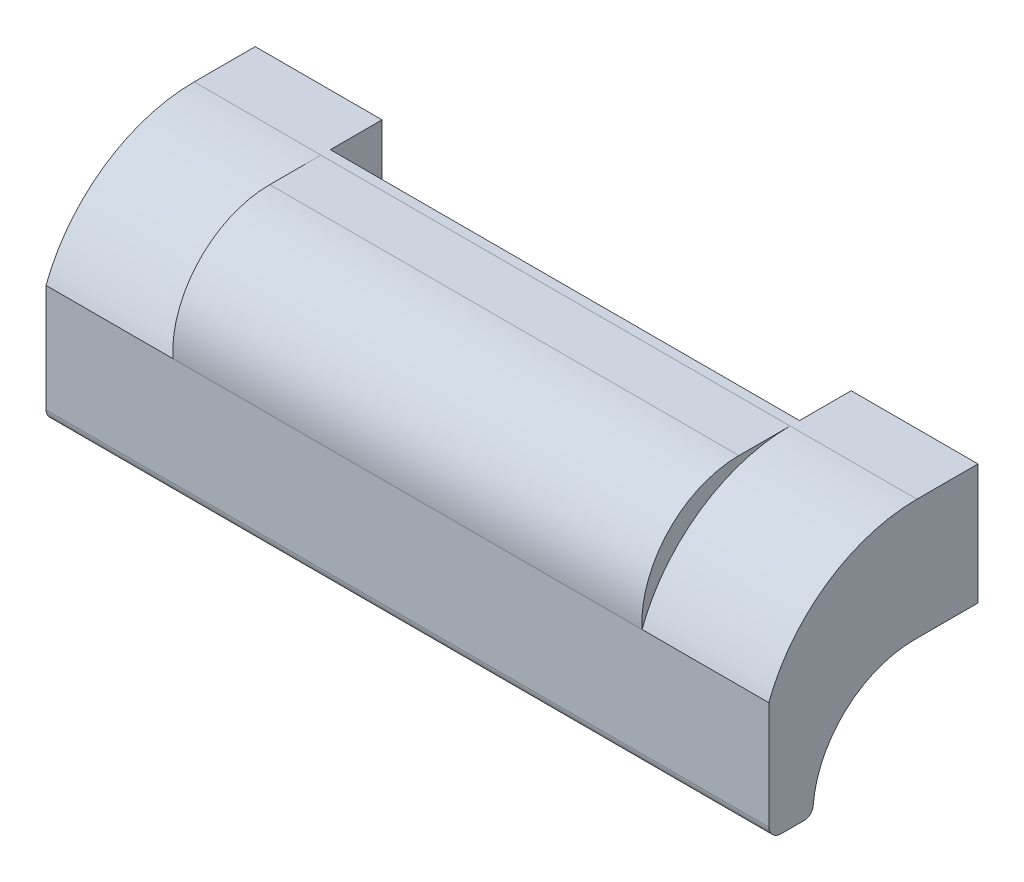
ISO-10303-21;
HEADER;
FILE_DESCRIPTION(('STEP AP214'),'2;1');
FILE_NAME('part.step','',(''),(''),'','','');
FILE_SCHEMA(('AUTOMOTIVE_DESIGN { 1 0 10303 214 1 1 1 1 }'));
ENDSEC;
DATA;
#1=APPLICATION_CONTEXT('core data for automotive mechanical design processes');
#2=APPLICATION_PROTOCOL_DEFINITION('international standard','automotive_design',2000,#1);
#3=PRODUCT_CONTEXT('',#1,'mechanical');
#4=PRODUCT('Part','Part','',(#3));
#5=PRODUCT_RELATED_PRODUCT_CATEGORY('part','',(#4));
#6=PRODUCT_DEFINITION_FORMATION('','',#4);
#7=PRODUCT_DEFINITION_CONTEXT('part definition',#1,'design');
#8=PRODUCT_DEFINITION('design','',#6,#7);
#9=PRODUCT_DEFINITION_SHAPE('','',#8);
#10=(LENGTH_UNIT() NAMED_UNIT(*) SI_UNIT(.MILLI.,.METRE.));
#11=(NAMED_UNIT(*) PLANE_ANGLE_UNIT() SI_UNIT($,.RADIAN.));
#12=(NAMED_UNIT(*) SI_UNIT($,.STERADIAN.) SOLID_ANGLE_UNIT());
#13=UNCERTAINTY_MEASURE_WITH_UNIT(LENGTH_MEASURE(1.E-05),#10,'distance_accuracy_value','');
#14=(GEOMETRIC_REPRESENTATION_CONTEXT(3) GLOBAL_UNCERTAINTY_ASSIGNED_CONTEXT((#13)) GLOBAL_UNIT_ASSIGNED_CONTEXT((#10,
#11,#12)) REPRESENTATION_CONTEXT('',''));
#15=CARTESIAN_POINT('',(0.,0.,0.));
#16=DIRECTION('',(0.,0.,1.));
#17=DIRECTION('',(1.,0.,0.));
#18=AXIS2_PLACEMENT_3D('',#15,#16,#17);
#19=CARTESIAN_POINT('',(0.,0.,11.01));
#20=DIRECTION('',(0.,0.,-1.));
#21=DIRECTION('',(-1.,0.,0.));
#22=AXIS2_PLACEMENT_3D('',#19,#20,#21);
#23=PLANE('',#22);
#24=DIRECTION('',(0.5,0.866025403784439,0.));
#25=VECTOR('',#24,1.);
#26=CARTESIAN_POINT('',(99.2735026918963,0.,11.01));
#27=LINE('',#26,#25);
#28=CARTESIAN_POINT('',(99.2735026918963,0.,11.01));
#29=VERTEX_POINT('',#28);
#30=CARTESIAN_POINT('',(96.3867513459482,-5.00000000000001,11.01));
#31=VERTEX_POINT('',#30);
#32=EDGE_CURVE('E286',#29,#31,#27,.F.);
#33=ORIENTED_EDGE('',*,*,#32,.T.);
#34=DIRECTION('',(1.,0.,0.));
#35=VECTOR('',#34,1.);
#36=CARTESIAN_POINT('',(96.3867513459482,-5.,11.01));
#37=LINE('',#36,#35);
#38=CARTESIAN_POINT('',(90.6132486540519,-4.99999999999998,11.01));
#39=VERTEX_POINT('',#38);
#40=EDGE_CURVE('E280',#31,#39,#37,.F.);
#41=ORIENTED_EDGE('',*,*,#40,.T.);
#42=DIRECTION('',(0.499999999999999,-0.86602540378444,0.));
#43=VECTOR('',#42,1.);
#44=CARTESIAN_POINT('',(90.6132486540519,-4.99999999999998,11.01));
#45=LINE('',#44,#43);
#46=CARTESIAN_POINT('',(87.7264973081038,0.,11.01));
#47=VERTEX_POINT('',#46);
#48=EDGE_CURVE('E274',#39,#47,#45,.F.);
#49=ORIENTED_EDGE('',*,*,#48,.T.);
#50=DIRECTION('',(-0.499999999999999,-0.866025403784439,0.));
#51=VECTOR('',#50,1.);
#52=CARTESIAN_POINT('',(87.7264973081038,0.,11.01));
#53=LINE('',#52,#51);
#54=CARTESIAN_POINT('',(90.6132486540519,5.,11.01));
#55=VERTEX_POINT('',#54);
#56=EDGE_CURVE('E303',#47,#55,#53,.F.);
#57=ORIENTED_EDGE('',*,*,#56,.T.);
#58=DIRECTION('',(-1.,0.,0.));
#59=VECTOR('',#58,1.);
#60=CARTESIAN_POINT('',(90.6132486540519,5.,11.01));
#61=LINE('',#60,#59);
#62=CARTESIAN_POINT('',(96.3867513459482,5.,11.01));
#63=VERTEX_POINT('',#62);
#64=EDGE_CURVE('E298',#55,#63,#61,.F.);
#65=ORIENTED_EDGE('',*,*,#64,.T.);
#66=DIRECTION('',(-0.5,0.866025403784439,0.));
#67=VECTOR('',#66,1.);
#68=CARTESIAN_POINT('',(96.3867513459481,5.,11.01));
#69=LINE('',#68,#67);
#70=EDGE_CURVE('E292',#63,#29,#69,.F.);
#71=ORIENTED_EDGE('',*,*,#70,.T.);
#72=EDGE_LOOP('',(#33,#41,#49,#57,#65,#71));
#73=FACE_BOUND('',#72,.T.);
#74=ADVANCED_FACE('F14',(#73),#23,.T.);
#75=CARTESIAN_POINT('',(0.,0.,11.01));
#76=DIRECTION('',(0.,0.,-1.));
#77=DIRECTION('',(-1.,0.,0.));
#78=AXIS2_PLACEMENT_3D('',#75,#76,#77);
#79=PLANE('',#78);
#80=DIRECTION('',(0.5,0.866025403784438,0.));
#81=VECTOR('',#80,1.);
#82=CARTESIAN_POINT('',(5.77350269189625,0.,11.01));
#83=LINE('',#82,#81);
#84=CARTESIAN_POINT('',(5.77350269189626,0.,11.01));
#85=VERTEX_POINT('',#84);
#86=CARTESIAN_POINT('',(2.88675134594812,-5.,11.01));
#87=VERTEX_POINT('',#86);
#88=EDGE_CURVE('E251',#85,#87,#83,.F.);
#89=ORIENTED_EDGE('',*,*,#88,.T.);
#90=DIRECTION('',(1.,0.,0.));
#91=VECTOR('',#90,1.);
#92=CARTESIAN_POINT('',(2.88675134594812,-5.,11.01));
#93=LINE('',#92,#91);
#94=CARTESIAN_POINT('',(-2.88675134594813,-5.,11.01));
#95=VERTEX_POINT('',#94);
#96=EDGE_CURVE('E245',#87,#95,#93,.F.);
#97=ORIENTED_EDGE('',*,*,#96,.T.);
#98=DIRECTION('',(0.499999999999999,-0.866025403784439,0.));
#99=VECTOR('',#98,1.);
#100=CARTESIAN_POINT('',(-2.88675134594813,-5.,11.01));
#101=LINE('',#100,#99);
#102=CARTESIAN_POINT('',(-5.77350269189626,0.,11.01));
#103=VERTEX_POINT('',#102);
#104=EDGE_CURVE('E239',#95,#103,#101,.F.);
#105=ORIENTED_EDGE('',*,*,#104,.T.);
#106=DIRECTION('',(-0.5,-0.866025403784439,0.));
#107=VECTOR('',#106,1.);
#108=CARTESIAN_POINT('',(-5.77350269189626,0.,11.01));
#109=LINE('',#108,#107);
#110=CARTESIAN_POINT('',(-2.88675134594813,5.,11.01));
#111=VERTEX_POINT('',#110);
#112=EDGE_CURVE('E269',#103,#111,#109,.F.);
#113=ORIENTED_EDGE('',*,*,#112,.T.);
#114=DIRECTION('',(-1.,0.,0.));
#115=VECTOR('',#114,1.);
#116=CARTESIAN_POINT('',(-2.88675134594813,5.,11.01));
#117=LINE('',#116,#115);
#118=CARTESIAN_POINT('',(2.88675134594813,5.,11.01));
#119=VERTEX_POINT('',#118);
#120=EDGE_CURVE('E263',#111,#119,#117,.F.);
#121=ORIENTED_EDGE('',*,*,#120,.T.);
#122=DIRECTION('',(-0.5,0.866025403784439,0.));
#123=VECTOR('',#122,1.);
#124=CARTESIAN_POINT('',(2.88675134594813,5.,11.01));
#125=LINE('',#124,#123);
#126=EDGE_CURVE('E257',#119,#85,#125,.F.);
#127=ORIENTED_EDGE('',*,*,#126,.T.);
#128=EDGE_LOOP('',(#89,#97,#105,#113,#121,#127));
#129=FACE_BOUND('',#128,.T.);
#130=ADVANCED_FACE('F857',(#129),#79,.T.);
#131=CARTESIAN_POINT('',(87.7264973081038,0.,11.01));
#132=DIRECTION('',(-0.866025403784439,0.499999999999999,0.));
#133=DIRECTION('',(-0.499999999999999,-0.866025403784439,0.));
#134=AXIS2_PLACEMENT_3D('',#131,#132,#133);
#135=PLANE('',#134);
#136=DIRECTION('',(0.,0.,1.));
#137=VECTOR('',#136,1.);
#138=CARTESIAN_POINT('',(90.6132486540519,5.,11.01));
#139=LINE('',#138,#137);
#140=CARTESIAN_POINT('',(90.6132486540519,5.,6.00000000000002));
#141=VERTEX_POINT('',#140);
#142=EDGE_CURVE('E301',#141,#55,#139,.T.);
#143=ORIENTED_EDGE('',*,*,#142,.T.);
#144=ORIENTED_EDGE('',*,*,#56,.F.);
#145=DIRECTION('',(0.,0.,1.));
#146=VECTOR('',#145,1.);
#147=CARTESIAN_POINT('',(87.7264973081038,0.,11.01));
#148=LINE('',#147,#146);
#149=CARTESIAN_POINT('',(87.7264973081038,0.,6.00000000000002));
#150=VERTEX_POINT('',#149);
#151=EDGE_CURVE('E272',#47,#150,#148,.F.);
#152=ORIENTED_EDGE('',*,*,#151,.T.);
#153=DIRECTION('',(0.499999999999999,0.866025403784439,0.));
#154=VECTOR('',#153,1.);
#155=CARTESIAN_POINT('',(87.7264973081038,0.,6.0000000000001));
#156=LINE('',#155,#154);
#157=EDGE_CURVE('E220',#150,#141,#156,.T.);
#158=ORIENTED_EDGE('',*,*,#157,.T.);
#159=EDGE_LOOP('',(#143,#144,#152,#158));
#160=FACE_BOUND('',#159,.T.);
#161=ADVANCED_FACE('F510',(#160),#135,.F.);
#162=CARTESIAN_POINT('',(90.6132486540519,5.,11.01));
#163=DIRECTION('',(0.,1.,0.));
#164=DIRECTION('',(-1.,0.,0.));
#165=AXIS2_PLACEMENT_3D('',#162,#163,#164);
#166=PLANE('',#165);
#167=DIRECTION('',(0.,0.,1.));
#168=VECTOR('',#167,1.);
#169=CARTESIAN_POINT('',(96.3867513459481,5.,11.01));
#170=LINE('',#169,#168);
#171=CARTESIAN_POINT('',(96.3867513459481,5.,6.00000000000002));
#172=VERTEX_POINT('',#171);
#173=EDGE_CURVE('E295',#172,#63,#170,.T.);
#174=ORIENTED_EDGE('',*,*,#173,.T.);
#175=ORIENTED_EDGE('',*,*,#64,.F.);
#176=ORIENTED_EDGE('',*,*,#142,.F.);
#177=DIRECTION('',(-1.,0.,0.));
#178=VECTOR('',#177,1.);
#179=CARTESIAN_POINT('',(93.5,5.,6.0000000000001));
#180=LINE('',#179,#178);
#181=EDGE_CURVE('E222',#141,#172,#180,.F.);
#182=ORIENTED_EDGE('',*,*,#181,.T.);
#183=EDGE_LOOP('',(#174,#175,#176,#182));
#184=FACE_BOUND('',#183,.T.);
#185=ADVANCED_FACE('F503',(#184),#166,.F.);
#186=CARTESIAN_POINT('',(96.3867513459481,5.,11.01));
#187=DIRECTION('',(0.866025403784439,0.5,0.));
#188=DIRECTION('',(-0.5,0.866025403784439,0.));
#189=AXIS2_PLACEMENT_3D('',#186,#187,#188);
#190=PLANE('',#189);
#191=DIRECTION('',(0.,0.,1.));
#192=VECTOR('',#191,1.);
#193=CARTESIAN_POINT('',(99.2735026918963,0.,11.01));
#194=LINE('',#193,#192);
#195=CARTESIAN_POINT('',(99.2735026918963,0.,6.00000000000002));
#196=VERTEX_POINT('',#195);
#197=EDGE_CURVE('E289',#196,#29,#194,.T.);
#198=ORIENTED_EDGE('',*,*,#197,.T.);
#199=ORIENTED_EDGE('',*,*,#70,.F.);
#200=ORIENTED_EDGE('',*,*,#173,.F.);
#201=DIRECTION('',(0.500000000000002,-0.866025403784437,0.));
#202=VECTOR('',#201,1.);
#203=CARTESIAN_POINT('',(96.3867513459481,5.,6.0000000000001));
#204=LINE('',#203,#202);
#205=EDGE_CURVE('E230',#172,#196,#204,.T.);
#206=ORIENTED_EDGE('',*,*,#205,.T.);
#207=EDGE_LOOP('',(#198,#199,#200,#206));
#208=FACE_BOUND('',#207,.T.);
#209=ADVANCED_FACE('F487',(#208),#190,.F.);
#210=CARTESIAN_POINT('',(99.2735026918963,0.,11.01));
#211=DIRECTION('',(0.866025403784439,-0.5,0.));
#212=DIRECTION('',(0.5,0.866025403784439,0.));
#213=AXIS2_PLACEMENT_3D('',#210,#211,#212);
#214=PLANE('',#213);
#215=DIRECTION('',(0.,0.,1.));
#216=VECTOR('',#215,1.);
#217=CARTESIAN_POINT('',(96.3867513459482,-5.,11.01));
#218=LINE('',#217,#216);
#219=CARTESIAN_POINT('',(96.3867513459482,-5.00000000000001,6.00000000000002));
#220=VERTEX_POINT('',#219);
#221=EDGE_CURVE('E283',#220,#31,#218,.T.);
#222=ORIENTED_EDGE('',*,*,#221,.T.);
#223=ORIENTED_EDGE('',*,*,#32,.F.);
#224=ORIENTED_EDGE('',*,*,#197,.F.);
#225=DIRECTION('',(-0.500000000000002,-0.866025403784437,0.));
#226=VECTOR('',#225,1.);
#227=CARTESIAN_POINT('',(99.2735026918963,0.,6.0000000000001));
#228=LINE('',#227,#226);
#229=EDGE_CURVE('E480',#196,#220,#228,.T.);
#230=ORIENTED_EDGE('',*,*,#229,.T.);
#231=EDGE_LOOP('',(#222,#223,#224,#230));
#232=FACE_BOUND('',#231,.T.);
#233=ADVANCED_FACE('F847',(#232),#214,.F.);
#234=CARTESIAN_POINT('',(96.3867513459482,-5.,11.01));
#235=DIRECTION('',(0.,-1.,0.));
#236=DIRECTION('',(1.,0.,0.));
#237=AXIS2_PLACEMENT_3D('',#234,#235,#236);
#238=PLANE('',#237);
#239=DIRECTION('',(0.,0.,1.));
#240=VECTOR('',#239,1.);
#241=CARTESIAN_POINT('',(90.6132486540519,-4.99999999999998,11.01));
#242=LINE('',#241,#240);
#243=CARTESIAN_POINT('',(90.6132486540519,-4.99999999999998,6.00000000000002));
#244=VERTEX_POINT('',#243);
#245=EDGE_CURVE('E277',#244,#39,#242,.T.);
#246=ORIENTED_EDGE('',*,*,#245,.T.);
#247=ORIENTED_EDGE('',*,*,#40,.F.);
#248=ORIENTED_EDGE('',*,*,#221,.F.);
#249=DIRECTION('',(-1.,0.,0.));
#250=VECTOR('',#249,1.);
#251=CARTESIAN_POINT('',(93.5,-5.,6.0000000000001));
#252=LINE('',#251,#250);
#253=EDGE_CURVE('E477',#220,#244,#252,.T.);
#254=ORIENTED_EDGE('',*,*,#253,.T.);
#255=EDGE_LOOP('',(#246,#247,#248,#254));
#256=FACE_BOUND('',#255,.T.);
#257=ADVANCED_FACE('F843',(#256),#238,.F.);
#258=CARTESIAN_POINT('',(90.6132486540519,-4.99999999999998,11.01));
#259=DIRECTION('',(-0.86602540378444,-0.499999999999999,0.));
#260=DIRECTION('',(0.499999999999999,-0.86602540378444,0.));
#261=AXIS2_PLACEMENT_3D('',#258,#259,#260);
#262=PLANE('',#261);
#263=ORIENTED_EDGE('',*,*,#151,.F.);
#264=ORIENTED_EDGE('',*,*,#48,.F.);
#265=ORIENTED_EDGE('',*,*,#245,.F.);
#266=DIRECTION('',(-0.499999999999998,0.866025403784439,0.));
#267=VECTOR('',#266,1.);
#268=CARTESIAN_POINT('',(90.6132486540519,-4.99999999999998,6.0000000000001));
#269=LINE('',#268,#267);
#270=EDGE_CURVE('E474',#244,#150,#269,.T.);
#271=ORIENTED_EDGE('',*,*,#270,.T.);
#272=EDGE_LOOP('',(#263,#264,#265,#271));
#273=FACE_BOUND('',#272,.T.);
#274=ADVANCED_FACE('F839',(#273),#262,.F.);
#275=CARTESIAN_POINT('',(-5.77350269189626,0.,11.01));
#276=DIRECTION('',(-0.866025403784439,0.5,0.));
#277=DIRECTION('',(-0.5,-0.866025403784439,0.));
#278=AXIS2_PLACEMENT_3D('',#275,#276,#277);
#279=PLANE('',#278);
#280=DIRECTION('',(0.,0.,1.));
#281=VECTOR('',#280,1.);
#282=CARTESIAN_POINT('',(-2.88675134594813,5.,11.01));
#283=LINE('',#282,#281);
#284=CARTESIAN_POINT('',(-2.88675134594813,5.,6.00000000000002));
#285=VERTEX_POINT('',#284);
#286=EDGE_CURVE('E266',#285,#111,#283,.T.);
#287=ORIENTED_EDGE('',*,*,#286,.T.);
#288=ORIENTED_EDGE('',*,*,#112,.F.);
#289=DIRECTION('',(0.,0.,1.));
#290=VECTOR('',#289,1.);
#291=CARTESIAN_POINT('',(-5.77350269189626,0.,11.01));
#292=LINE('',#291,#290);
#293=CARTESIAN_POINT('',(-5.77350269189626,0.,6.00000000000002));
#294=VERTEX_POINT('',#293);
#295=EDGE_CURVE('E164',#103,#294,#292,.F.);
#296=ORIENTED_EDGE('',*,*,#295,.T.);
#297=DIRECTION('',(0.5,0.866025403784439,0.));
#298=VECTOR('',#297,1.);
#299=CARTESIAN_POINT('',(-5.77350269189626,0.,6.0000000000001));
#300=LINE('',#299,#298);
#301=EDGE_CURVE('E471',#294,#285,#300,.T.);
#302=ORIENTED_EDGE('',*,*,#301,.T.);
#303=EDGE_LOOP('',(#287,#288,#296,#302));
#304=FACE_BOUND('',#303,.T.);
#305=ADVANCED_FACE('F835',(#304),#279,.F.);
#306=CARTESIAN_POINT('',(-2.88675134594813,5.,11.01));
#307=DIRECTION('',(0.,1.,0.));
#308=DIRECTION('',(-1.,0.,0.));
#309=AXIS2_PLACEMENT_3D('',#306,#307,#308);
#310=PLANE('',#309);
#311=DIRECTION('',(0.,0.,1.));
#312=VECTOR('',#311,1.);
#313=CARTESIAN_POINT('',(2.88675134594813,5.,11.01));
#314=LINE('',#313,#312);
#315=CARTESIAN_POINT('',(2.88675134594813,5.,6.00000000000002));
#316=VERTEX_POINT('',#315);
#317=EDGE_CURVE('E260',#316,#119,#314,.T.);
#318=ORIENTED_EDGE('',*,*,#317,.T.);
#319=ORIENTED_EDGE('',*,*,#120,.F.);
#320=ORIENTED_EDGE('',*,*,#286,.F.);
#321=DIRECTION('',(-1.,0.,0.));
#322=VECTOR('',#321,1.);
#323=CARTESIAN_POINT('',(0.,5.,6.0000000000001));
#324=LINE('',#323,#322);
#325=EDGE_CURVE('E468',#285,#316,#324,.F.);
#326=ORIENTED_EDGE('',*,*,#325,.T.);
#327=EDGE_LOOP('',(#318,#319,#320,#326));
#328=FACE_BOUND('',#327,.T.);
#329=ADVANCED_FACE('F831',(#328),#310,.F.);
#330=CARTESIAN_POINT('',(2.88675134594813,5.,11.01));
#331=DIRECTION('',(0.866025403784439,0.5,0.));
#332=DIRECTION('',(-0.5,0.866025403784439,0.));
#333=AXIS2_PLACEMENT_3D('',#330,#331,#332);
#334=PLANE('',#333);
#335=DIRECTION('',(0.,0.,1.));
#336=VECTOR('',#335,1.);
#337=CARTESIAN_POINT('',(5.77350269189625,0.,11.01));
#338=LINE('',#337,#336);
#339=CARTESIAN_POINT('',(5.77350269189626,0.,6.00000000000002));
#340=VERTEX_POINT('',#339);
#341=EDGE_CURVE('E254',#340,#85,#338,.T.);
#342=ORIENTED_EDGE('',*,*,#341,.T.);
#343=ORIENTED_EDGE('',*,*,#126,.F.);
#344=ORIENTED_EDGE('',*,*,#317,.F.);
#345=DIRECTION('',(0.499999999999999,-0.866025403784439,0.));
#346=VECTOR('',#345,1.);
#347=CARTESIAN_POINT('',(2.88675134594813,5.,6.0000000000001));
#348=LINE('',#347,#346);
#349=EDGE_CURVE('E465',#316,#340,#348,.T.);
#350=ORIENTED_EDGE('',*,*,#349,.T.);
#351=EDGE_LOOP('',(#342,#343,#344,#350));
#352=FACE_BOUND('',#351,.T.);
#353=ADVANCED_FACE('F827',(#352),#334,.F.);
#354=CARTESIAN_POINT('',(5.77350269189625,0.,11.01));
#355=DIRECTION('',(0.866025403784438,-0.5,0.));
#356=DIRECTION('',(0.5,0.866025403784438,0.));
#357=AXIS2_PLACEMENT_3D('',#354,#355,#356);
#358=PLANE('',#357);
#359=DIRECTION('',(0.,0.,-1.));
#360=VECTOR('',#359,1.);
#361=CARTESIAN_POINT('',(2.88675134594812,-5.,11.01));
#362=LINE('',#361,#360);
#363=CARTESIAN_POINT('',(2.88675134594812,-5.,6.00000000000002));
#364=VERTEX_POINT('',#363);
#365=EDGE_CURVE('E248',#364,#87,#362,.F.);
#366=ORIENTED_EDGE('',*,*,#365,.T.);
#367=ORIENTED_EDGE('',*,*,#88,.F.);
#368=ORIENTED_EDGE('',*,*,#341,.F.);
#369=DIRECTION('',(-0.5,-0.866025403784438,0.));
#370=VECTOR('',#369,1.);
#371=CARTESIAN_POINT('',(5.77350269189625,0.,6.0000000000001));
#372=LINE('',#371,#370);
#373=EDGE_CURVE('E462',#340,#364,#372,.T.);
#374=ORIENTED_EDGE('',*,*,#373,.T.);
#375=EDGE_LOOP('',(#366,#367,#368,#374));
#376=FACE_BOUND('',#375,.T.);
#377=ADVANCED_FACE('F823',(#376),#358,.F.);
#378=CARTESIAN_POINT('',(2.88675134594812,-5.,11.01));
#379=DIRECTION('',(0.,-1.,0.));
#380=DIRECTION('',(0.,0.,-1.));
#381=AXIS2_PLACEMENT_3D('',#378,#379,#380);
#382=PLANE('',#381);
#383=DIRECTION('',(0.,0.,1.));
#384=VECTOR('',#383,1.);
#385=CARTESIAN_POINT('',(-2.88675134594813,-5.,11.01));
#386=LINE('',#385,#384);
#387=CARTESIAN_POINT('',(-2.88675134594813,-5.,6.00000000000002));
#388=VERTEX_POINT('',#387);
#389=EDGE_CURVE('E242',#388,#95,#386,.T.);
#390=ORIENTED_EDGE('',*,*,#389,.T.);
#391=ORIENTED_EDGE('',*,*,#96,.F.);
#392=ORIENTED_EDGE('',*,*,#365,.F.);
#393=DIRECTION('',(-1.,0.,0.));
#394=VECTOR('',#393,1.);
#395=CARTESIAN_POINT('',(0.,-5.,6.0000000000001));
#396=LINE('',#395,#394);
#397=EDGE_CURVE('E459',#364,#388,#396,.T.);
#398=ORIENTED_EDGE('',*,*,#397,.T.);
#399=EDGE_LOOP('',(#390,#391,#392,#398));
#400=FACE_BOUND('',#399,.T.);
#401=ADVANCED_FACE('F819',(#400),#382,.F.);
#402=CARTESIAN_POINT('',(-2.88675134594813,-5.,11.01));
#403=DIRECTION('',(-0.866025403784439,-0.499999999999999,0.));
#404=DIRECTION('',(0.499999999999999,-0.866025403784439,0.));
#405=AXIS2_PLACEMENT_3D('',#402,#403,#404);
#406=PLANE('',#405);
#407=ORIENTED_EDGE('',*,*,#295,.F.);
#408=ORIENTED_EDGE('',*,*,#104,.F.);
#409=ORIENTED_EDGE('',*,*,#389,.F.);
#410=DIRECTION('',(-0.499999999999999,0.866025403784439,0.));
#411=VECTOR('',#410,1.);
#412=CARTESIAN_POINT('',(-2.88675134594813,-5.,6.0000000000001));
#413=LINE('',#412,#411);
#414=EDGE_CURVE('E219',#388,#294,#413,.T.);
#415=ORIENTED_EDGE('',*,*,#414,.T.);
#416=EDGE_LOOP('',(#407,#408,#409,#415));
#417=FACE_BOUND('',#416,.T.);
#418=ADVANCED_FACE('F814',(#417),#406,.F.);
#419=CARTESIAN_POINT('',(101.25,-24.2117925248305,26.7117925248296));
#420=DIRECTION('',(-1.,0.,0.));
#421=DIRECTION('',(0.,0.,1.));
#422=AXIS2_PLACEMENT_3D('',#419,#420,#421);
#423=CYLINDRICAL_SURFACE('',#422,0.711792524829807);
#424=CARTESIAN_POINT('',(-7.75000000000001,-24.2117925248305,26.7117925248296));
#425=DIRECTION('',(-1.,0.,0.));
#426=DIRECTION('',(0.,0.,1.));
#427=AXIS2_PLACEMENT_3D('',#424,#425,#426);
#428=CIRCLE('',#427,0.711792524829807);
#429=CARTESIAN_POINT('',(-7.75,-24.2117925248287,25.9999999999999));
#430=VERTEX_POINT('',#429);
#431=CARTESIAN_POINT('',(-7.75000000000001,-23.5000000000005,26.7117925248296));
#432=VERTEX_POINT('',#431);
#433=EDGE_CURVE('E163',#430,#432,#428,.F.);
#434=ORIENTED_EDGE('',*,*,#433,.T.);
#435=DIRECTION('',(1.,0.,0.));
#436=VECTOR('',#435,1.);
#437=CARTESIAN_POINT('',(101.25,-23.5000000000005,26.7117925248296));
#438=LINE('',#437,#436);
#439=CARTESIAN_POINT('',(101.25,-23.5000000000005,26.7117925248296));
#440=VERTEX_POINT('',#439);
#441=EDGE_CURVE('E158',#432,#440,#438,.T.);
#442=ORIENTED_EDGE('',*,*,#441,.T.);
#443=CARTESIAN_POINT('',(101.25,-24.2117925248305,26.7117925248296));
#444=DIRECTION('',(-1.,0.,0.));
#445=DIRECTION('',(0.,0.,1.));
#446=AXIS2_PLACEMENT_3D('',#443,#444,#445);
#447=CIRCLE('',#446,0.711792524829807);
#448=CARTESIAN_POINT('',(101.25,-24.2117925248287,25.9999999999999));
#449=VERTEX_POINT('',#448);
#450=EDGE_CURVE('E17',#440,#449,#447,.T.);
#451=ORIENTED_EDGE('',*,*,#450,.T.);
#452=DIRECTION('',(1.,0.,0.));
#453=VECTOR('',#452,1.);
#454=CARTESIAN_POINT('',(-10.25,-24.2117925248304,26.0000000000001));
#455=LINE('',#454,#453);
#456=EDGE_CURVE('E155',#430,#449,#455,.T.);
#457=ORIENTED_EDGE('',*,*,#456,.F.);
#458=EDGE_LOOP('',(#434,#442,#451,#457));
#459=FACE_BOUND('',#458,.T.);
#460=ADVANCED_FACE('F154',(#459),#423,.T.);
#461=CARTESIAN_POINT('',(9.75,-5.77996517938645,17.742658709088));
#462=DIRECTION('',(1.,0.,0.));
#463=DIRECTION('',(0.,0.,-1.));
#464=AXIS2_PLACEMENT_3D('',#461,#462,#463);
#465=CYLINDRICAL_SURFACE('',#464,15.28);
#466=DIRECTION('',(-1.,0.,0.));
#467=VECTOR('',#466,1.);
#468=CARTESIAN_POINT('',(-10.25,-6.61179252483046,33.));
#469=LINE('',#468,#467);
#470=CARTESIAN_POINT('',(9.75,-6.61179252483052,33.0000000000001));
#471=VERTEX_POINT('',#470);
#472=CARTESIAN_POINT('',(83.75,-6.61179252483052,33.0000000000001));
#473=VERTEX_POINT('',#472);
#474=EDGE_CURVE('E386',#471,#473,#469,.F.);
#475=ORIENTED_EDGE('',*,*,#474,.T.);
#476=CARTESIAN_POINT('',(83.75,-5.77996517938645,17.742658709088));
#477=DIRECTION('',(1.,0.,0.));
#478=DIRECTION('',(0.,0.,-1.));
#479=AXIS2_PLACEMENT_3D('',#476,#477,#478);
#480=CIRCLE('',#479,15.28);
#481=CARTESIAN_POINT('',(83.75,9.49999999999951,17.7100379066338));
#482=VERTEX_POINT('',#481);
#483=EDGE_CURVE('E175',#473,#482,#480,.F.);
#484=ORIENTED_EDGE('',*,*,#483,.T.);
#485=DIRECTION('',(1.,0.,0.));
#486=VECTOR('',#485,1.);
#487=CARTESIAN_POINT('',(9.75,9.49999999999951,17.7100379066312));
#488=LINE('',#487,#486);
#489=CARTESIAN_POINT('',(9.75,9.49999999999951,17.7100379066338));
#490=VERTEX_POINT('',#489);
#491=EDGE_CURVE('E234',#490,#482,#488,.T.);
#492=ORIENTED_EDGE('',*,*,#491,.F.);
#493=CARTESIAN_POINT('',(9.75,-5.77996517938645,17.742658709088));
#494=DIRECTION('',(-1.,0.,0.));
#495=DIRECTION('',(0.,0.,1.));
#496=AXIS2_PLACEMENT_3D('',#493,#494,#495);
#497=CIRCLE('',#496,15.28);
#498=EDGE_CURVE('E214',#471,#490,#497,.T.);
#499=ORIENTED_EDGE('',*,*,#498,.F.);
#500=EDGE_LOOP('',(#475,#484,#492,#499));
#501=FACE_BOUND('',#500,.T.);
#502=ADVANCED_FACE('F721',(#501),#465,.T.);
#503=CARTESIAN_POINT('',(93.5,8.66025403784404,6.0000000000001));
#504=DIRECTION('',(0.,0.,-1.));
#505=DIRECTION('',(-1.,0.,0.));
#506=AXIS2_PLACEMENT_3D('',#503,#504,#505);
#507=PLANE('',#506);
#508=ORIENTED_EDGE('',*,*,#253,.F.);
#509=ORIENTED_EDGE('',*,*,#229,.F.);
#510=ORIENTED_EDGE('',*,*,#205,.F.);
#511=ORIENTED_EDGE('',*,*,#181,.F.);
#512=ORIENTED_EDGE('',*,*,#157,.F.);
#513=ORIENTED_EDGE('',*,*,#270,.F.);
#514=EDGE_LOOP('',(#508,#509,#510,#511,#512,#513));
#515=FACE_BOUND('',#514,.T.);
#516=CARTESIAN_POINT('',(93.5,0.,6.0000000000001));
#517=DIRECTION('',(0.,0.,-1.));
#518=DIRECTION('',(-1.,0.,0.));
#519=AXIS2_PLACEMENT_3D('',#516,#517,#518);
#520=CIRCLE('',#519,3.24999999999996);
#521=CARTESIAN_POINT('',(90.25,0.,6.0000000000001));
#522=VERTEX_POINT('',#521);
#523=EDGE_CURVE('E207',#522,#522,#520,.T.);
#524=ORIENTED_EDGE('',*,*,#523,.T.);
#525=EDGE_LOOP('',(#524));
#526=FACE_BOUND('',#525,.T.);
#527=ADVANCED_FACE('F498',(#515,#526),#507,.F.);
#528=CARTESIAN_POINT('',(0.,8.66025403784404,6.0000000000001));
#529=DIRECTION('',(0.,0.,-1.));
#530=DIRECTION('',(-1.,0.,0.));
#531=AXIS2_PLACEMENT_3D('',#528,#529,#530);
#532=PLANE('',#531);
#533=ORIENTED_EDGE('',*,*,#397,.F.);
#534=ORIENTED_EDGE('',*,*,#373,.F.);
#535=ORIENTED_EDGE('',*,*,#349,.F.);
#536=ORIENTED_EDGE('',*,*,#325,.F.);
#537=ORIENTED_EDGE('',*,*,#301,.F.);
#538=ORIENTED_EDGE('',*,*,#414,.F.);
#539=EDGE_LOOP('',(#533,#534,#535,#536,#537,#538));
#540=FACE_BOUND('',#539,.T.);
#541=CARTESIAN_POINT('',(0.,0.,6.0000000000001));
#542=DIRECTION('',(0.,0.,-1.));
#543=DIRECTION('',(-1.,0.,0.));
#544=AXIS2_PLACEMENT_3D('',#541,#542,#543);
#545=CIRCLE('',#544,3.24999999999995);
#546=CARTESIAN_POINT('',(-3.24999999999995,0.,6.0000000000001));
#547=VERTEX_POINT('',#546);
#548=EDGE_CURVE('E204',#547,#547,#545,.T.);
#549=ORIENTED_EDGE('',*,*,#548,.T.);
#550=EDGE_LOOP('',(#549));
#551=FACE_BOUND('',#550,.T.);
#552=ADVANCED_FACE('F708',(#540,#551),#532,.F.);
#553=CARTESIAN_POINT('',(101.25,-23.0000000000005,29.5));
#554=DIRECTION('',(-1.,0.,0.));
#555=DIRECTION('',(0.,0.,1.));
#556=AXIS2_PLACEMENT_3D('',#553,#554,#555);
#557=CYLINDRICAL_SURFACE('',#556,0.500000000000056);
#558=CARTESIAN_POINT('',(-7.75000000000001,-23.0000000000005,29.5));
#559=DIRECTION('',(-1.,0.,0.));
#560=DIRECTION('',(0.,0.,1.));
#561=AXIS2_PLACEMENT_3D('',#558,#559,#560);
#562=CIRCLE('',#561,0.500000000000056);
#563=CARTESIAN_POINT('',(-7.75000000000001,-23.5000000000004,29.5));
#564=VERTEX_POINT('',#563);
#565=CARTESIAN_POINT('',(-7.75000000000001,-23.0000000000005,30.));
#566=VERTEX_POINT('',#565);
#567=EDGE_CURVE('E201',#564,#566,#562,.T.);
#568=ORIENTED_EDGE('',*,*,#567,.T.);
#569=DIRECTION('',(1.,0.,0.));
#570=VECTOR('',#569,1.);
#571=CARTESIAN_POINT('',(101.25,-23.0000000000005,30.));
#572=LINE('',#571,#570);
#573=CARTESIAN_POINT('',(101.25,-23.0000000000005,30.));
#574=VERTEX_POINT('',#573);
#575=EDGE_CURVE('E422',#566,#574,#572,.T.);
#576=ORIENTED_EDGE('',*,*,#575,.T.);
#577=CARTESIAN_POINT('',(101.25,-23.0000000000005,29.5));
#578=DIRECTION('',(-1.,0.,0.));
#579=DIRECTION('',(0.,0.,1.));
#580=AXIS2_PLACEMENT_3D('',#577,#578,#579);
#581=CIRCLE('',#580,0.500000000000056);
#582=CARTESIAN_POINT('',(101.25,-23.5000000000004,29.5));
#583=VERTEX_POINT('',#582);
#584=EDGE_CURVE('E217',#583,#574,#581,.T.);
#585=ORIENTED_EDGE('',*,*,#584,.F.);
#586=DIRECTION('',(1.,0.,0.));
#587=VECTOR('',#586,1.);
#588=CARTESIAN_POINT('',(101.25,-23.5000000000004,29.5));
#589=LINE('',#588,#587);
#590=EDGE_CURVE('E218',#583,#564,#589,.F.);
#591=ORIENTED_EDGE('',*,*,#590,.T.);
#592=EDGE_LOOP('',(#568,#576,#585,#591));
#593=FACE_BOUND('',#592,.T.);
#594=ADVANCED_FACE('F710',(#593),#557,.F.);
#595=CARTESIAN_POINT('',(101.25,-23.5000000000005,26.7117925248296));
#596=DIRECTION('',(0.,-1.,0.));
#597=DIRECTION('',(0.,0.,-1.));
#598=AXIS2_PLACEMENT_3D('',#595,#596,#597);
#599=PLANE('',#598);
#600=DIRECTION('',(0.,0.,1.));
#601=VECTOR('',#600,1.);
#602=CARTESIAN_POINT('',(-7.75,-23.5000000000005,29.5));
#603=LINE('',#602,#601);
#604=EDGE_CURVE('E203',#432,#564,#603,.T.);
#605=ORIENTED_EDGE('',*,*,#604,.T.);
#606=ORIENTED_EDGE('',*,*,#590,.F.);
#607=DIRECTION('',(0.,0.,1.));
#608=VECTOR('',#607,1.);
#609=CARTESIAN_POINT('',(101.25,-23.5000000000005,29.5));
#610=LINE('',#609,#608);
#611=EDGE_CURVE('E193',#440,#583,#610,.T.);
#612=ORIENTED_EDGE('',*,*,#611,.F.);
#613=ORIENTED_EDGE('',*,*,#441,.F.);
#614=EDGE_LOOP('',(#605,#606,#612,#613));
#615=FACE_BOUND('',#614,.T.);
#616=ADVANCED_FACE('F718',(#615),#599,.F.);
#617=CARTESIAN_POINT('',(9.75,-5.77996517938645,17.742658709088));
#618=DIRECTION('',(-1.,0.,0.));
#619=DIRECTION('',(0.,0.,1.));
#620=AXIS2_PLACEMENT_3D('',#617,#618,#619);
#621=PLANE('',#620);
#622=ORIENTED_EDGE('',*,*,#498,.T.);
#623=DIRECTION('',(0.,0.,1.));
#624=VECTOR('',#623,1.);
#625=CARTESIAN_POINT('',(9.75,9.49999999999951,9.6490922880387));
#626=LINE('',#625,#624);
#627=CARTESIAN_POINT('',(9.75,9.49999628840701,9.64909228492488));
#628=VERTEX_POINT('',#627);
#629=EDGE_CURVE('E216',#628,#490,#626,.T.);
#630=ORIENTED_EDGE('',*,*,#629,.F.);
#631=CARTESIAN_POINT('',(9.75,-15.5000000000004,9.6333620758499));
#632=DIRECTION('',(1.,0.,0.));
#633=DIRECTION('',(0.,0.,-1.));
#634=AXIS2_PLACEMENT_3D('',#631,#632,#633);
#635=CIRCLE('',#634,25.);
#636=EDGE_CURVE('E349',#471,#628,#635,.F.);
#637=ORIENTED_EDGE('',*,*,#636,.F.);
#638=EDGE_LOOP('',(#622,#630,#637));
#639=FACE_BOUND('',#638,.T.);
#640=ADVANCED_FACE('F785',(#639),#621,.T.);
#641=CARTESIAN_POINT('',(9.75,9.49999999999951,9.6490922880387));
#642=DIRECTION('',(0.,1.,0.));
#643=DIRECTION('',(0.,0.,1.));
#644=AXIS2_PLACEMENT_3D('',#641,#642,#643);
#645=PLANE('',#644);
#646=ORIENTED_EDGE('',*,*,#491,.T.);
#647=DIRECTION('',(0.,0.,1.));
#648=VECTOR('',#647,1.);
#649=CARTESIAN_POINT('',(83.75,9.49999999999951,17.742658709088));
#650=LINE('',#649,#648);
#651=CARTESIAN_POINT('',(83.75,9.49999628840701,9.64909228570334));
#652=VERTEX_POINT('',#651);
#653=EDGE_CURVE('E213',#482,#652,#650,.F.);
#654=ORIENTED_EDGE('',*,*,#653,.T.);
#655=DIRECTION('',(1.,0.,0.));
#656=VECTOR('',#655,1.);
#657=CARTESIAN_POINT('',(-10.25,9.49999505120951,9.64909228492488));
#658=LINE('',#657,#656);
#659=EDGE_CURVE('E348',#628,#652,#658,.T.);
#660=ORIENTED_EDGE('',*,*,#659,.F.);
#661=ORIENTED_EDGE('',*,*,#629,.T.);
#662=EDGE_LOOP('',(#646,#654,#660,#661));
#663=FACE_BOUND('',#662,.T.);
#664=ADVANCED_FACE('F781',(#663),#645,.T.);
#665=CARTESIAN_POINT('',(83.75,-5.77996517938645,17.742658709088));
#666=DIRECTION('',(-1.,0.,0.));
#667=DIRECTION('',(0.,0.,1.));
#668=AXIS2_PLACEMENT_3D('',#665,#666,#667);
#669=PLANE('',#668);
#670=CARTESIAN_POINT('',(83.75,-15.5000000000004,9.6333620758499));
#671=DIRECTION('',(1.,0.,0.));
#672=DIRECTION('',(0.,0.,-1.));
#673=AXIS2_PLACEMENT_3D('',#670,#671,#672);
#674=CIRCLE('',#673,25.);
#675=EDGE_CURVE('E345',#652,#473,#674,.T.);
#676=ORIENTED_EDGE('',*,*,#675,.F.);
#677=ORIENTED_EDGE('',*,*,#653,.F.);
#678=ORIENTED_EDGE('',*,*,#483,.F.);
#679=EDGE_LOOP('',(#676,#677,#678));
#680=FACE_BOUND('',#679,.T.);
#681=ADVANCED_FACE('F778',(#680),#669,.F.);
#682=CARTESIAN_POINT('',(-10.25,-24.0989933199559,27.3964583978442));
#683=DIRECTION('',(1.,0.,0.));
#684=DIRECTION('',(0.,0.,-1.));
#685=AXIS2_PLACEMENT_3D('',#682,#683,#684);
#686=CYLINDRICAL_SURFACE('',#685,1.40100668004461);
#687=DIRECTION('',(1.,0.,0.));
#688=VECTOR('',#687,1.);
#689=CARTESIAN_POINT('',(-10.25,-24.2117925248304,26.0000000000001));
#690=LINE('',#689,#688);
#691=CARTESIAN_POINT('',(103.75,-24.2117925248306,26.0000000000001));
#692=VERTEX_POINT('',#691);
#693=EDGE_CURVE('E169',#449,#692,#690,.T.);
#694=ORIENTED_EDGE('',*,*,#693,.T.);
#695=CARTESIAN_POINT('',(103.75,-24.0989933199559,27.3964583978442));
#696=DIRECTION('',(1.,0.,0.));
#697=DIRECTION('',(0.,0.,-1.));
#698=AXIS2_PLACEMENT_3D('',#695,#696,#697);
#699=CIRCLE('',#698,1.40100668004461);
#700=CARTESIAN_POINT('',(103.75,-25.5000000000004,27.3964583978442));
#701=VERTEX_POINT('',#700);
#702=EDGE_CURVE('E338',#692,#701,#699,.F.);
#703=ORIENTED_EDGE('',*,*,#702,.T.);
#704=DIRECTION('',(1.,0.,0.));
#705=VECTOR('',#704,1.);
#706=CARTESIAN_POINT('',(-10.25,-25.5000000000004,27.3964583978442));
#707=LINE('',#706,#705);
#708=CARTESIAN_POINT('',(-10.25,-25.5000000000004,27.3964583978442));
#709=VERTEX_POINT('',#708);
#710=EDGE_CURVE('E174',#701,#709,#707,.F.);
#711=ORIENTED_EDGE('',*,*,#710,.T.);
#712=CARTESIAN_POINT('',(-10.25,-24.0989933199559,27.3964583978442));
#713=DIRECTION('',(1.,0.,0.));
#714=DIRECTION('',(0.,0.,-1.));
#715=AXIS2_PLACEMENT_3D('',#712,#713,#714);
#716=CIRCLE('',#715,1.40100668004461);
#717=CARTESIAN_POINT('',(-10.25,-24.2117925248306,26.0000000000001));
#718=VERTEX_POINT('',#717);
#719=EDGE_CURVE('E355',#718,#709,#716,.F.);
#720=ORIENTED_EDGE('',*,*,#719,.F.);
#721=DIRECTION('',(1.,0.,0.));
#722=VECTOR('',#721,1.);
#723=CARTESIAN_POINT('',(-10.25,-24.2117925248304,26.0000000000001));
#724=LINE('',#723,#722);
#725=EDGE_CURVE('E172',#718,#430,#724,.T.);
#726=ORIENTED_EDGE('',*,*,#725,.T.);
#727=ORIENTED_EDGE('',*,*,#456,.T.);
#728=EDGE_LOOP('',(#694,#703,#711,#720,#726,#727));
#729=FACE_BOUND('',#728,.T.);
#730=ADVANCED_FACE('F167',(#729),#686,.T.);
#731=CARTESIAN_POINT('',(-10.25,-25.5000000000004,27.3964583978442));
#732=DIRECTION('',(0.,1.,0.));
#733=DIRECTION('',(0.,0.,1.));
#734=AXIS2_PLACEMENT_3D('',#731,#732,#733);
#735=PLANE('',#734);
#736=DIRECTION('',(0.,0.,1.));
#737=VECTOR('',#736,1.);
#738=CARTESIAN_POINT('',(-10.25,-25.5000000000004,9.6333620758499));
#739=LINE('',#738,#737);
#740=CARTESIAN_POINT('',(-10.25,-25.5000000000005,31.0031268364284));
#741=VERTEX_POINT('',#740);
#742=EDGE_CURVE('E354',#709,#741,#739,.T.);
#743=ORIENTED_EDGE('',*,*,#742,.F.);
#744=ORIENTED_EDGE('',*,*,#710,.F.);
#745=DIRECTION('',(0.,0.,1.));
#746=VECTOR('',#745,1.);
#747=CARTESIAN_POINT('',(103.75,-25.5000000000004,9.6333620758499));
#748=LINE('',#747,#746);
#749=CARTESIAN_POINT('',(103.75,-25.5000000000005,31.0031268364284));
#750=VERTEX_POINT('',#749);
#751=EDGE_CURVE('E337',#701,#750,#748,.T.);
#752=ORIENTED_EDGE('',*,*,#751,.T.);
#753=DIRECTION('',(1.,0.,0.));
#754=VECTOR('',#753,1.);
#755=CARTESIAN_POINT('',(-10.25,-25.5000000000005,31.0031268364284));
#756=LINE('',#755,#754);
#757=EDGE_CURVE('E372',#741,#750,#756,.T.);
#758=ORIENTED_EDGE('',*,*,#757,.F.);
#759=EDGE_LOOP('',(#743,#744,#752,#758));
#760=FACE_BOUND('',#759,.T.);
#761=ADVANCED_FACE('F375',(#760),#735,.F.);
#762=CARTESIAN_POINT('',(-10.25,-23.5000000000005,31.0031268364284));
#763=DIRECTION('',(1.,0.,0.));
#764=DIRECTION('',(0.,0.,-1.));
#765=AXIS2_PLACEMENT_3D('',#762,#763,#764);
#766=CYLINDRICAL_SURFACE('',#765,2.00000000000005);
#767=ORIENTED_EDGE('',*,*,#757,.T.);
#768=CARTESIAN_POINT('',(103.75,-23.5000000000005,31.0031268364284));
#769=DIRECTION('',(1.,0.,0.));
#770=DIRECTION('',(0.,0.,-1.));
#771=AXIS2_PLACEMENT_3D('',#768,#769,#770);
#772=CIRCLE('',#771,2.00000000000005);
#773=CARTESIAN_POINT('',(103.75,-23.6117925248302,33.));
#774=VERTEX_POINT('',#773);
#775=EDGE_CURVE('E334',#750,#774,#772,.F.);
#776=ORIENTED_EDGE('',*,*,#775,.T.);
#777=DIRECTION('',(-1.,0.,0.));
#778=VECTOR('',#777,1.);
#779=CARTESIAN_POINT('',(-10.25,-23.6117925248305,33.));
#780=LINE('',#779,#778);
#781=CARTESIAN_POINT('',(-10.25,-23.6117925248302,33.));
#782=VERTEX_POINT('',#781);
#783=EDGE_CURVE('E210',#774,#782,#780,.T.);
#784=ORIENTED_EDGE('',*,*,#783,.T.);
#785=CARTESIAN_POINT('',(-10.25,-23.5000000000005,31.0031268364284));
#786=DIRECTION('',(1.,0.,0.));
#787=DIRECTION('',(0.,0.,-1.));
#788=AXIS2_PLACEMENT_3D('',#785,#786,#787);
#789=CIRCLE('',#788,2.00000000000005);
#790=EDGE_CURVE('E352',#741,#782,#789,.F.);
#791=ORIENTED_EDGE('',*,*,#790,.F.);
#792=EDGE_LOOP('',(#767,#776,#784,#791));
#793=FACE_BOUND('',#792,.T.);
#794=ADVANCED_FACE('F381',(#793),#766,.T.);
#795=CARTESIAN_POINT('',(-10.25,-23.6117925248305,33.));
#796=DIRECTION('',(0.,0.,-1.));
#797=DIRECTION('',(-1.,0.,0.));
#798=AXIS2_PLACEMENT_3D('',#795,#796,#797);
#799=PLANE('',#798);
#800=ORIENTED_EDGE('',*,*,#783,.F.);
#801=DIRECTION('',(0.,1.,0.));
#802=VECTOR('',#801,1.);
#803=CARTESIAN_POINT('',(103.75,-15.5000000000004,33.));
#804=LINE('',#803,#802);
#805=CARTESIAN_POINT('',(103.75,-6.61179252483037,33.));
#806=VERTEX_POINT('',#805);
#807=EDGE_CURVE('E333',#774,#806,#804,.T.);
#808=ORIENTED_EDGE('',*,*,#807,.T.);
#809=DIRECTION('',(1.,0.,0.));
#810=VECTOR('',#809,1.);
#811=CARTESIAN_POINT('',(-10.25,-6.61179252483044,33.));
#812=LINE('',#811,#810);
#813=EDGE_CURVE('E344',#473,#806,#812,.T.);
#814=ORIENTED_EDGE('',*,*,#813,.F.);
#815=ORIENTED_EDGE('',*,*,#474,.F.);
#816=DIRECTION('',(1.,0.,0.));
#817=VECTOR('',#816,1.);
#818=CARTESIAN_POINT('',(-10.25,-6.61179252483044,33.));
#819=LINE('',#818,#817);
#820=CARTESIAN_POINT('',(-10.25,-6.61179252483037,33.));
#821=VERTEX_POINT('',#820);
#822=EDGE_CURVE('E351',#821,#471,#819,.T.);
#823=ORIENTED_EDGE('',*,*,#822,.F.);
#824=DIRECTION('',(0.,1.,0.));
#825=VECTOR('',#824,1.);
#826=CARTESIAN_POINT('',(-10.25,-15.5000000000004,33.));
#827=LINE('',#826,#825);
#828=EDGE_CURVE('E353',#782,#821,#827,.T.);
#829=ORIENTED_EDGE('',*,*,#828,.F.);
#830=EDGE_LOOP('',(#800,#808,#814,#815,#823,#829));
#831=FACE_BOUND('',#830,.T.);
#832=ADVANCED_FACE('F389',(#831),#799,.F.);
#833=CARTESIAN_POINT('',(93.5,0.,6.0000000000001));
#834=DIRECTION('',(0.,0.,-1.));
#835=DIRECTION('',(-1.,0.,0.));
#836=AXIS2_PLACEMENT_3D('',#833,#834,#835);
#837=CYLINDRICAL_SURFACE('',#836,3.24999999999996);
#838=CARTESIAN_POINT('',(93.5,0.,0.));
#839=DIRECTION('',(0.,0.,-1.));
#840=DIRECTION('',(-1.,0.,0.));
#841=AXIS2_PLACEMENT_3D('',#838,#839,#840);
#842=CIRCLE('',#841,3.24999999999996);
#843=CARTESIAN_POINT('',(90.25,0.,0.));
#844=VERTEX_POINT('',#843);
#845=EDGE_CURVE('E327',#844,#844,#842,.F.);
#846=ORIENTED_EDGE('',*,*,#845,.F.);
#847=EDGE_LOOP('',(#846));
#848=FACE_BOUND('',#847,.T.);
#849=ORIENTED_EDGE('',*,*,#523,.F.);
#850=EDGE_LOOP('',(#849));
#851=FACE_BOUND('',#850,.T.);
#852=ADVANCED_FACE('F704',(#848,#851),#837,.F.);
#853=CARTESIAN_POINT('',(0.,0.,6.0000000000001));
#854=DIRECTION('',(0.,0.,-1.));
#855=DIRECTION('',(-1.,0.,0.));
#856=AXIS2_PLACEMENT_3D('',#853,#854,#855);
#857=CYLINDRICAL_SURFACE('',#856,3.24999999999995);
#858=CARTESIAN_POINT('',(0.,0.,0.));
#859=DIRECTION('',(0.,0.,-1.));
#860=DIRECTION('',(-1.,0.,0.));
#861=AXIS2_PLACEMENT_3D('',#858,#859,#860);
#862=CIRCLE('',#861,3.24999999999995);
#863=CARTESIAN_POINT('',(-3.24999999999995,0.,0.));
#864=VERTEX_POINT('',#863);
#865=EDGE_CURVE('E322',#864,#864,#862,.F.);
#866=ORIENTED_EDGE('',*,*,#865,.F.);
#867=EDGE_LOOP('',(#866));
#868=FACE_BOUND('',#867,.T.);
#869=ORIENTED_EDGE('',*,*,#548,.F.);
#870=EDGE_LOOP('',(#869));
#871=FACE_BOUND('',#870,.T.);
#872=ADVANCED_FACE('F700',(#868,#871),#857,.F.);
#873=CARTESIAN_POINT('',(-10.25,-25.5,10.0519430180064));
#874=DIRECTION('',(1.,0.,0.));
#875=DIRECTION('',(0.,0.,-1.));
#876=AXIS2_PLACEMENT_3D('',#873,#874,#875);
#877=CYLINDRICAL_SURFACE('',#876,16.);
#878=ORIENTED_EDGE('',*,*,#725,.F.);
#879=CARTESIAN_POINT('',(-10.25,-25.5,10.0519430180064));
#880=DIRECTION('',(1.,0.,0.));
#881=DIRECTION('',(0.,0.,-1.));
#882=AXIS2_PLACEMENT_3D('',#879,#880,#881);
#883=CIRCLE('',#882,16.);
#884=CARTESIAN_POINT('',(-10.25,-9.5,10.0519430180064));
#885=VERTEX_POINT('',#884);
#886=EDGE_CURVE('E184',#885,#718,#883,.T.);
#887=ORIENTED_EDGE('',*,*,#886,.F.);
#888=DIRECTION('',(1.,0.,0.));
#889=VECTOR('',#888,1.);
#890=CARTESIAN_POINT('',(-10.25,-9.5,10.0519430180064));
#891=LINE('',#890,#889);
#892=CARTESIAN_POINT('',(-7.75,-9.5,10.0519430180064));
#893=VERTEX_POINT('',#892);
#894=EDGE_CURVE('E434',#885,#893,#891,.T.);
#895=ORIENTED_EDGE('',*,*,#894,.T.);
#896=CARTESIAN_POINT('',(-7.75,-25.5,10.0519430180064));
#897=DIRECTION('',(1.,0.,0.));
#898=DIRECTION('',(0.,0.,-1.));
#899=AXIS2_PLACEMENT_3D('',#896,#897,#898);
#900=CIRCLE('',#899,16.);
#901=EDGE_CURVE('E198',#893,#430,#900,.T.);
#902=ORIENTED_EDGE('',*,*,#901,.T.);
#903=EDGE_LOOP('',(#878,#887,#895,#902));
#904=FACE_BOUND('',#903,.T.);
#905=ADVANCED_FACE('F703',(#904),#877,.F.);
#906=CARTESIAN_POINT('',(-7.75,-23.0000000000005,29.5));
#907=DIRECTION('',(-1.,0.,0.));
#908=DIRECTION('',(0.,0.,1.));
#909=AXIS2_PLACEMENT_3D('',#906,#907,#908);
#910=PLANE('',#909);
#911=DIRECTION('',(0.,0.,1.));
#912=VECTOR('',#911,1.);
#913=CARTESIAN_POINT('',(-7.75,-9.5,0.));
#914=LINE('',#913,#912);
#915=CARTESIAN_POINT('',(-7.75,-9.5,30.));
#916=VERTEX_POINT('',#915);
#917=EDGE_CURVE('E425',#893,#916,#914,.T.);
#918=ORIENTED_EDGE('',*,*,#917,.T.);
#919=DIRECTION('',(0.,1.,0.));
#920=VECTOR('',#919,1.);
#921=CARTESIAN_POINT('',(-7.75000000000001,-23.0000000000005,30.));
#922=LINE('',#921,#920);
#923=EDGE_CURVE('E200',#916,#566,#922,.F.);
#924=ORIENTED_EDGE('',*,*,#923,.T.);
#925=ORIENTED_EDGE('',*,*,#567,.F.);
#926=ORIENTED_EDGE('',*,*,#604,.F.);
#927=ORIENTED_EDGE('',*,*,#433,.F.);
#928=ORIENTED_EDGE('',*,*,#901,.F.);
#929=EDGE_LOOP('',(#918,#924,#925,#926,#927,#928));
#930=FACE_BOUND('',#929,.T.);
#931=ADVANCED_FACE('F760',(#930),#910,.F.);
#932=CARTESIAN_POINT('',(101.25,-23.0000000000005,30.));
#933=DIRECTION('',(0.,0.,1.));
#934=DIRECTION('',(1.,0.,0.));
#935=AXIS2_PLACEMENT_3D('',#932,#933,#934);
#936=PLANE('',#935);
#937=ORIENTED_EDGE('',*,*,#923,.F.);
#938=DIRECTION('',(1.,0.,0.));
#939=VECTOR('',#938,1.);
#940=CARTESIAN_POINT('',(-10.25,-9.5,30.));
#941=LINE('',#940,#939);
#942=CARTESIAN_POINT('',(101.25,-9.5,30.));
#943=VERTEX_POINT('',#942);
#944=EDGE_CURVE('E416',#916,#943,#941,.T.);
#945=ORIENTED_EDGE('',*,*,#944,.T.);
#946=DIRECTION('',(0.,1.,0.));
#947=VECTOR('',#946,1.);
#948=CARTESIAN_POINT('',(101.25,-23.0000000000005,30.));
#949=LINE('',#948,#947);
#950=EDGE_CURVE('E191',#574,#943,#949,.T.);
#951=ORIENTED_EDGE('',*,*,#950,.F.);
#952=ORIENTED_EDGE('',*,*,#575,.F.);
#953=EDGE_LOOP('',(#937,#945,#951,#952));
#954=FACE_BOUND('',#953,.T.);
#955=ADVANCED_FACE('F757',(#954),#936,.F.);
#956=CARTESIAN_POINT('',(101.25,-23.0000000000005,29.5));
#957=DIRECTION('',(-1.,0.,0.));
#958=DIRECTION('',(0.,0.,1.));
#959=AXIS2_PLACEMENT_3D('',#956,#957,#958);
#960=PLANE('',#959);
#961=DIRECTION('',(0.,0.,1.));
#962=VECTOR('',#961,1.);
#963=CARTESIAN_POINT('',(101.25,-9.5,0.));
#964=LINE('',#963,#962);
#965=CARTESIAN_POINT('',(101.25,-9.5,10.0519430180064));
#966=VERTEX_POINT('',#965);
#967=EDGE_CURVE('E190',#943,#966,#964,.F.);
#968=ORIENTED_EDGE('',*,*,#967,.T.);
#969=CARTESIAN_POINT('',(101.25,-25.5,10.0519430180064));
#970=DIRECTION('',(1.,0.,0.));
#971=DIRECTION('',(0.,0.,-1.));
#972=AXIS2_PLACEMENT_3D('',#969,#970,#971);
#973=CIRCLE('',#972,16.);
#974=EDGE_CURVE('E181',#966,#449,#973,.T.);
#975=ORIENTED_EDGE('',*,*,#974,.T.);
#976=ORIENTED_EDGE('',*,*,#450,.F.);
#977=ORIENTED_EDGE('',*,*,#611,.T.);
#978=ORIENTED_EDGE('',*,*,#584,.T.);
#979=ORIENTED_EDGE('',*,*,#950,.T.);
#980=EDGE_LOOP('',(#968,#975,#976,#977,#978,#979));
#981=FACE_BOUND('',#980,.T.);
#982=ADVANCED_FACE('F187',(#981),#960,.T.);
#983=CARTESIAN_POINT('',(-10.25,-25.5,10.0519430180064));
#984=DIRECTION('',(1.,0.,0.));
#985=DIRECTION('',(0.,0.,-1.));
#986=AXIS2_PLACEMENT_3D('',#983,#984,#985);
#987=CYLINDRICAL_SURFACE('',#986,16.);
#988=ORIENTED_EDGE('',*,*,#974,.F.);
#989=DIRECTION('',(1.,0.,0.));
#990=VECTOR('',#989,1.);
#991=CARTESIAN_POINT('',(-10.25,-9.5,10.0519430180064));
#992=LINE('',#991,#990);
#993=CARTESIAN_POINT('',(103.75,-9.5,10.0519430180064));
#994=VERTEX_POINT('',#993);
#995=EDGE_CURVE('E411',#966,#994,#992,.T.);
#996=ORIENTED_EDGE('',*,*,#995,.T.);
#997=CARTESIAN_POINT('',(103.75,-25.5,10.0519430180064));
#998=DIRECTION('',(1.,0.,0.));
#999=DIRECTION('',(0.,0.,-1.));
#1000=AXIS2_PLACEMENT_3D('',#997,#998,#999);
#1001=CIRCLE('',#1000,16.);
#1002=EDGE_CURVE('E183',#994,#692,#1001,.T.);
#1003=ORIENTED_EDGE('',*,*,#1002,.T.);
#1004=ORIENTED_EDGE('',*,*,#693,.F.);
#1005=EDGE_LOOP('',(#988,#996,#1003,#1004));
#1006=FACE_BOUND('',#1005,.T.);
#1007=ADVANCED_FACE('F179',(#1006),#987,.F.);
#1008=CARTESIAN_POINT('',(-10.25,-15.5000000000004,9.6333620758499));
#1009=DIRECTION('',(-1.,0.,0.));
#1010=DIRECTION('',(0.,0.,1.));
#1011=AXIS2_PLACEMENT_3D('',#1008,#1009,#1010);
#1012=PLANE('',#1011);
#1013=ORIENTED_EDGE('',*,*,#790,.T.);
#1014=ORIENTED_EDGE('',*,*,#828,.T.);
#1015=CARTESIAN_POINT('',(-10.25,-15.5000000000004,9.6333620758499));
#1016=DIRECTION('',(1.,0.,0.));
#1017=DIRECTION('',(0.,0.,-1.));
#1018=AXIS2_PLACEMENT_3D('',#1015,#1016,#1017);
#1019=CIRCLE('',#1018,25.);
#1020=CARTESIAN_POINT('',(-10.25,9.49999999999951,9.6333620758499));
#1021=VERTEX_POINT('',#1020);
#1022=EDGE_CURVE('E341',#1021,#821,#1019,.T.);
#1023=ORIENTED_EDGE('',*,*,#1022,.F.);
#1024=DIRECTION('',(0.,0.,1.));
#1025=VECTOR('',#1024,1.);
#1026=CARTESIAN_POINT('',(-10.25,9.49999999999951,0.));
#1027=LINE('',#1026,#1025);
#1028=CARTESIAN_POINT('',(-10.25,9.49999999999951,0.));
#1029=VERTEX_POINT('',#1028);
#1030=EDGE_CURVE('E641',#1029,#1021,#1027,.T.);
#1031=ORIENTED_EDGE('',*,*,#1030,.F.);
#1032=DIRECTION('',(0.,1.,0.));
#1033=VECTOR('',#1032,1.);
#1034=CARTESIAN_POINT('',(-10.25,-9.5,0.));
#1035=LINE('',#1034,#1033);
#1036=CARTESIAN_POINT('',(-10.25,-9.5,0.));
#1037=VERTEX_POINT('',#1036);
#1038=EDGE_CURVE('E325',#1037,#1029,#1035,.T.);
#1039=ORIENTED_EDGE('',*,*,#1038,.F.);
#1040=DIRECTION('',(0.,0.,1.));
#1041=VECTOR('',#1040,1.);
#1042=CARTESIAN_POINT('',(-10.25,-9.5,0.));
#1043=LINE('',#1042,#1041);
#1044=EDGE_CURVE('E364',#1037,#885,#1043,.T.);
#1045=ORIENTED_EDGE('',*,*,#1044,.T.);
#1046=ORIENTED_EDGE('',*,*,#886,.T.);
#1047=ORIENTED_EDGE('',*,*,#719,.T.);
#1048=ORIENTED_EDGE('',*,*,#742,.T.);
#1049=EDGE_LOOP('',(#1013,#1014,#1023,#1031,#1039,#1045,#1046,#1047,#1048));
#1050=FACE_BOUND('',#1049,.T.);
#1051=ADVANCED_FACE('F361',(#1050),#1012,.T.);
#1052=CARTESIAN_POINT('',(-10.25,-15.5000000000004,9.6333620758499));
#1053=DIRECTION('',(1.,0.,0.));
#1054=DIRECTION('',(0.,0.,-1.));
#1055=AXIS2_PLACEMENT_3D('',#1052,#1053,#1054);
#1056=CYLINDRICAL_SURFACE('',#1055,25.);
#1057=DIRECTION('',(1.,0.,0.));
#1058=VECTOR('',#1057,1.);
#1059=CARTESIAN_POINT('',(-10.25,9.49999999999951,9.6333620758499));
#1060=LINE('',#1059,#1058);
#1061=CARTESIAN_POINT('',(103.75,9.49999999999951,9.6333620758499));
#1062=VERTEX_POINT('',#1061);
#1063=EDGE_CURVE('E660',#1021,#1062,#1060,.T.);
#1064=ORIENTED_EDGE('',*,*,#1063,.F.);
#1065=ORIENTED_EDGE('',*,*,#1022,.T.);
#1066=ORIENTED_EDGE('',*,*,#822,.T.);
#1067=ORIENTED_EDGE('',*,*,#636,.T.);
#1068=ORIENTED_EDGE('',*,*,#659,.T.);
#1069=ORIENTED_EDGE('',*,*,#675,.T.);
#1070=ORIENTED_EDGE('',*,*,#813,.T.);
#1071=CARTESIAN_POINT('',(103.75,-15.5000000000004,9.6333620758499));
#1072=DIRECTION('',(1.,0.,0.));
#1073=DIRECTION('',(0.,0.,-1.));
#1074=AXIS2_PLACEMENT_3D('',#1071,#1072,#1073);
#1075=CIRCLE('',#1074,25.);
#1076=EDGE_CURVE('E330',#806,#1062,#1075,.F.);
#1077=ORIENTED_EDGE('',*,*,#1076,.T.);
#1078=EDGE_LOOP('',(#1064,#1065,#1066,#1067,#1068,#1069,#1070,#1077));
#1079=FACE_BOUND('',#1078,.T.);
#1080=ADVANCED_FACE('F668',(#1079),#1056,.T.);
#1081=CARTESIAN_POINT('',(103.75,-15.5000000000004,9.6333620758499));
#1082=DIRECTION('',(-1.,0.,0.));
#1083=DIRECTION('',(0.,0.,1.));
#1084=AXIS2_PLACEMENT_3D('',#1081,#1082,#1083);
#1085=PLANE('',#1084);
#1086=ORIENTED_EDGE('',*,*,#807,.F.);
#1087=ORIENTED_EDGE('',*,*,#775,.F.);
#1088=ORIENTED_EDGE('',*,*,#751,.F.);
#1089=ORIENTED_EDGE('',*,*,#702,.F.);
#1090=ORIENTED_EDGE('',*,*,#1002,.F.);
#1091=DIRECTION('',(0.,0.,1.));
#1092=VECTOR('',#1091,1.);
#1093=CARTESIAN_POINT('',(103.75,-9.5,0.));
#1094=LINE('',#1093,#1092);
#1095=CARTESIAN_POINT('',(103.75,-9.5,0.));
#1096=VERTEX_POINT('',#1095);
#1097=EDGE_CURVE('E407',#994,#1096,#1094,.F.);
#1098=ORIENTED_EDGE('',*,*,#1097,.T.);
#1099=DIRECTION('',(0.,1.,0.));
#1100=VECTOR('',#1099,1.);
#1101=CARTESIAN_POINT('',(103.75,-9.5,0.));
#1102=LINE('',#1101,#1100);
#1103=CARTESIAN_POINT('',(103.75,9.49999999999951,0.));
#1104=VERTEX_POINT('',#1103);
#1105=EDGE_CURVE('E326',#1104,#1096,#1102,.F.);
#1106=ORIENTED_EDGE('',*,*,#1105,.F.);
#1107=DIRECTION('',(0.,0.,1.));
#1108=VECTOR('',#1107,1.);
#1109=CARTESIAN_POINT('',(103.75,9.49999999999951,0.));
#1110=LINE('',#1109,#1108);
#1111=EDGE_CURVE('E631',#1062,#1104,#1110,.F.);
#1112=ORIENTED_EDGE('',*,*,#1111,.F.);
#1113=ORIENTED_EDGE('',*,*,#1076,.F.);
#1114=EDGE_LOOP('',(#1086,#1087,#1088,#1089,#1090,#1098,#1106,#1112,#1113));
#1115=FACE_BOUND('',#1114,.T.);
#1116=ADVANCED_FACE('F673',(#1115),#1085,.F.);
#1117=CARTESIAN_POINT('',(-10.25,-9.5,0.));
#1118=DIRECTION('',(0.,0.,-1.));
#1119=DIRECTION('',(-1.,0.,0.));
#1120=AXIS2_PLACEMENT_3D('',#1117,#1118,#1119);
#1121=PLANE('',#1120);
#1122=DIRECTION('',(1.,0.,0.));
#1123=VECTOR('',#1122,1.);
#1124=CARTESIAN_POINT('',(-10.25,9.49999999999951,0.));
#1125=LINE('',#1124,#1123);
#1126=CARTESIAN_POINT('',(83.75,9.49999999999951,0.));
#1127=VERTEX_POINT('',#1126);
#1128=EDGE_CURVE('E642',#1104,#1127,#1125,.F.);
#1129=ORIENTED_EDGE('',*,*,#1128,.F.);
#1130=ORIENTED_EDGE('',*,*,#1105,.T.);
#1131=DIRECTION('',(1.,0.,0.));
#1132=VECTOR('',#1131,1.);
#1133=CARTESIAN_POINT('',(-10.25,-9.5,0.));
#1134=LINE('',#1133,#1132);
#1135=CARTESIAN_POINT('',(83.75,-9.5,0.));
#1136=VERTEX_POINT('',#1135);
#1137=EDGE_CURVE('E410',#1096,#1136,#1134,.F.);
#1138=ORIENTED_EDGE('',*,*,#1137,.T.);
#1139=DIRECTION('',(0.,1.,0.));
#1140=VECTOR('',#1139,1.);
#1141=CARTESIAN_POINT('',(83.75,-8.5,0.));
#1142=LINE('',#1141,#1140);
#1143=EDGE_CURVE('E619',#1127,#1136,#1142,.F.);
#1144=ORIENTED_EDGE('',*,*,#1143,.F.);
#1145=EDGE_LOOP('',(#1129,#1130,#1138,#1144));
#1146=FACE_BOUND('',#1145,.T.);
#1147=ORIENTED_EDGE('',*,*,#845,.T.);
#1148=EDGE_LOOP('',(#1147));
#1149=FACE_BOUND('',#1148,.T.);
#1150=ADVANCED_FACE('F677',(#1146,#1149),#1121,.T.);
#1151=CARTESIAN_POINT('',(-10.25,-9.5,0.));
#1152=DIRECTION('',(0.,0.,-1.));
#1153=DIRECTION('',(-1.,0.,0.));
#1154=AXIS2_PLACEMENT_3D('',#1151,#1152,#1153);
#1155=PLANE('',#1154);
#1156=ORIENTED_EDGE('',*,*,#1038,.T.);
#1157=DIRECTION('',(1.,0.,0.));
#1158=VECTOR('',#1157,1.);
#1159=CARTESIAN_POINT('',(-10.25,9.49999999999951,0.));
#1160=LINE('',#1159,#1158);
#1161=CARTESIAN_POINT('',(9.75,9.49999999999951,0.));
#1162=VERTEX_POINT('',#1161);
#1163=EDGE_CURVE('E639',#1162,#1029,#1160,.F.);
#1164=ORIENTED_EDGE('',*,*,#1163,.F.);
#1165=DIRECTION('',(0.,1.,0.));
#1166=VECTOR('',#1165,1.);
#1167=CARTESIAN_POINT('',(9.75,-8.5,0.));
#1168=LINE('',#1167,#1166);
#1169=CARTESIAN_POINT('',(9.75,-9.5,0.));
#1170=VERTEX_POINT('',#1169);
#1171=EDGE_CURVE('E591',#1162,#1170,#1168,.F.);
#1172=ORIENTED_EDGE('',*,*,#1171,.T.);
#1173=DIRECTION('',(1.,0.,0.));
#1174=VECTOR('',#1173,1.);
#1175=CARTESIAN_POINT('',(-10.25,-9.5,0.));
#1176=LINE('',#1175,#1174);
#1177=EDGE_CURVE('E400',#1170,#1037,#1176,.F.);
#1178=ORIENTED_EDGE('',*,*,#1177,.T.);
#1179=EDGE_LOOP('',(#1156,#1164,#1172,#1178));
#1180=FACE_BOUND('',#1179,.T.);
#1181=ORIENTED_EDGE('',*,*,#865,.T.);
#1182=EDGE_LOOP('',(#1181));
#1183=FACE_BOUND('',#1182,.T.);
#1184=ADVANCED_FACE('F694',(#1180,#1183),#1155,.T.);
#1185=CARTESIAN_POINT('',(-10.25,-9.5,0.));
#1186=DIRECTION('',(0.,1.,0.));
#1187=DIRECTION('',(0.,0.,1.));
#1188=AXIS2_PLACEMENT_3D('',#1185,#1186,#1187);
#1189=PLANE('',#1188);
#1190=ORIENTED_EDGE('',*,*,#1137,.F.);
#1191=ORIENTED_EDGE('',*,*,#1097,.F.);
#1192=ORIENTED_EDGE('',*,*,#995,.F.);
#1193=ORIENTED_EDGE('',*,*,#967,.F.);
#1194=ORIENTED_EDGE('',*,*,#944,.F.);
#1195=ORIENTED_EDGE('',*,*,#917,.F.);
#1196=ORIENTED_EDGE('',*,*,#894,.F.);
#1197=ORIENTED_EDGE('',*,*,#1044,.F.);
#1198=ORIENTED_EDGE('',*,*,#1177,.F.);
#1199=DIRECTION('',(0.,0.,1.));
#1200=VECTOR('',#1199,1.);
#1201=CARTESIAN_POINT('',(9.75,-9.5,25.2545902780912));
#1202=LINE('',#1201,#1200);
#1203=CARTESIAN_POINT('',(9.74999999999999,-9.50000000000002,25.2545902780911));
#1204=VERTEX_POINT('',#1203);
#1205=EDGE_CURVE('E317',#1170,#1204,#1202,.T.);
#1206=ORIENTED_EDGE('',*,*,#1205,.T.);
#1207=DIRECTION('',(-1.,0.,0.));
#1208=VECTOR('',#1207,1.);
#1209=CARTESIAN_POINT('',(83.75,-9.50000000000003,25.254590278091));
#1210=LINE('',#1209,#1208);
#1211=CARTESIAN_POINT('',(83.75,-9.50000000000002,25.2545902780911));
#1212=VERTEX_POINT('',#1211);
#1213=EDGE_CURVE('E629',#1212,#1204,#1210,.T.);
#1214=ORIENTED_EDGE('',*,*,#1213,.F.);
#1215=DIRECTION('',(0.,0.,1.));
#1216=VECTOR('',#1215,1.);
#1217=CARTESIAN_POINT('',(83.75,-9.5,25.2545902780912));
#1218=LINE('',#1217,#1216);
#1219=EDGE_CURVE('E321',#1136,#1212,#1218,.T.);
#1220=ORIENTED_EDGE('',*,*,#1219,.F.);
#1221=EDGE_LOOP('',(#1190,#1191,#1192,#1193,#1194,#1195,#1196,#1197,#1198,#1206,#1214,#1220));
#1222=FACE_BOUND('',#1221,.T.);
#1223=ADVANCED_FACE('F691',(#1222),#1189,.F.);
#1224=CARTESIAN_POINT('',(-10.25,9.49999999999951,0.));
#1225=DIRECTION('',(0.,1.,0.));
#1226=DIRECTION('',(0.,0.,1.));
#1227=AXIS2_PLACEMENT_3D('',#1224,#1225,#1226);
#1228=PLANE('',#1227);
#1229=ORIENTED_EDGE('',*,*,#1063,.T.);
#1230=ORIENTED_EDGE('',*,*,#1111,.T.);
#1231=ORIENTED_EDGE('',*,*,#1128,.T.);
#1232=DIRECTION('',(0.,0.,1.));
#1233=VECTOR('',#1232,1.);
#1234=CARTESIAN_POINT('',(83.75,9.49999999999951,25.2545902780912));
#1235=LINE('',#1234,#1233);
#1236=CARTESIAN_POINT('',(83.75,9.49999999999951,8.15107299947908));
#1237=VERTEX_POINT('',#1236);
#1238=EDGE_CURVE('E320',#1237,#1127,#1235,.F.);
#1239=ORIENTED_EDGE('',*,*,#1238,.F.);
#1240=DIRECTION('',(1.,0.,0.));
#1241=VECTOR('',#1240,1.);
#1242=CARTESIAN_POINT('',(83.75,9.49999999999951,8.15107299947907));
#1243=LINE('',#1242,#1241);
#1244=CARTESIAN_POINT('',(9.75,9.49999999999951,8.15107299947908));
#1245=VERTEX_POINT('',#1244);
#1246=EDGE_CURVE('E582',#1237,#1245,#1243,.F.);
#1247=ORIENTED_EDGE('',*,*,#1246,.T.);
#1248=DIRECTION('',(0.,0.,1.));
#1249=VECTOR('',#1248,1.);
#1250=CARTESIAN_POINT('',(9.75,9.49999999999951,25.2545902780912));
#1251=LINE('',#1250,#1249);
#1252=EDGE_CURVE('E586',#1245,#1162,#1251,.F.);
#1253=ORIENTED_EDGE('',*,*,#1252,.T.);
#1254=ORIENTED_EDGE('',*,*,#1163,.T.);
#1255=ORIENTED_EDGE('',*,*,#1030,.T.);
#1256=EDGE_LOOP('',(#1229,#1230,#1231,#1239,#1247,#1253,#1254,#1255));
#1257=FACE_BOUND('',#1256,.T.);
#1258=ADVANCED_FACE('F584',(#1257),#1228,.T.);
#1259=CARTESIAN_POINT('',(83.75,-8.5,25.2545902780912));
#1260=DIRECTION('',(-1.,0.,0.));
#1261=DIRECTION('',(0.,0.,1.));
#1262=AXIS2_PLACEMENT_3D('',#1259,#1260,#1261);
#1263=CYLINDRICAL_SURFACE('',#1262,1.00000000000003);
#1264=DIRECTION('',(1.,0.,0.));
#1265=VECTOR('',#1264,1.);
#1266=CARTESIAN_POINT('',(83.75,-7.5,25.2545902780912));
#1267=LINE('',#1266,#1265);
#1268=CARTESIAN_POINT('',(83.75,-7.5,25.2545902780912));
#1269=VERTEX_POINT('',#1268);
#1270=CARTESIAN_POINT('',(9.74999999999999,-7.5,25.2545902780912));
#1271=VERTEX_POINT('',#1270);
#1272=EDGE_CURVE('E600',#1269,#1271,#1267,.F.);
#1273=ORIENTED_EDGE('',*,*,#1272,.F.);
#1274=CARTESIAN_POINT('',(83.75,-8.5,25.2545902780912));
#1275=DIRECTION('',(-1.,0.,0.));
#1276=DIRECTION('',(0.,0.,1.));
#1277=AXIS2_PLACEMENT_3D('',#1274,#1275,#1276);
#1278=CIRCLE('',#1277,1.00000000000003);
#1279=EDGE_CURVE('E318',#1212,#1269,#1278,.F.);
#1280=ORIENTED_EDGE('',*,*,#1279,.F.);
#1281=ORIENTED_EDGE('',*,*,#1213,.T.);
#1282=CARTESIAN_POINT('',(9.74999999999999,-8.5,25.2545902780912));
#1283=DIRECTION('',(-1.,0.,0.));
#1284=DIRECTION('',(0.,0.,1.));
#1285=AXIS2_PLACEMENT_3D('',#1282,#1283,#1284);
#1286=CIRCLE('',#1285,1.00000000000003);
#1287=EDGE_CURVE('E313',#1204,#1271,#1286,.F.);
#1288=ORIENTED_EDGE('',*,*,#1287,.T.);
#1289=EDGE_LOOP('',(#1273,#1280,#1281,#1288));
#1290=FACE_BOUND('',#1289,.T.);
#1291=ADVANCED_FACE('F738',(#1290),#1263,.T.);
#1292=CARTESIAN_POINT('',(83.75,-8.5,25.2545902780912));
#1293=DIRECTION('',(-1.,0.,0.));
#1294=DIRECTION('',(0.,0.,1.));
#1295=AXIS2_PLACEMENT_3D('',#1292,#1293,#1294);
#1296=PLANE('',#1295);
#1297=DIRECTION('',(0.,-0.999985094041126,-0.00546000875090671));
#1298=VECTOR('',#1297,1.);
#1299=CARTESIAN_POINT('',(83.75,7.49999999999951,8.1401528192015));
#1300=LINE('',#1299,#1298);
#1301=CARTESIAN_POINT('',(83.75,7.49999999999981,8.14015281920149));
#1302=VERTEX_POINT('',#1301);
#1303=EDGE_CURVE('E592',#1302,#1237,#1300,.F.);
#1304=ORIENTED_EDGE('',*,*,#1303,.T.);
#1305=ORIENTED_EDGE('',*,*,#1238,.T.);
#1306=ORIENTED_EDGE('',*,*,#1143,.T.);
#1307=ORIENTED_EDGE('',*,*,#1219,.T.);
#1308=ORIENTED_EDGE('',*,*,#1279,.T.);
#1309=DIRECTION('',(0.,0.,1.));
#1310=VECTOR('',#1309,1.);
#1311=CARTESIAN_POINT('',(83.75,-7.5,31.));
#1312=LINE('',#1311,#1310);
#1313=CARTESIAN_POINT('',(83.75,-7.49999999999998,31.0000000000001));
#1314=VERTEX_POINT('',#1313);
#1315=EDGE_CURVE('E312',#1314,#1269,#1312,.F.);
#1316=ORIENTED_EDGE('',*,*,#1315,.F.);
#1317=CARTESIAN_POINT('',(83.75,-15.0463055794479,9.69710648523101));
#1318=DIRECTION('',(-1.,0.,0.));
#1319=DIRECTION('',(0.,0.,1.));
#1320=AXIS2_PLACEMENT_3D('',#1317,#1318,#1319);
#1321=CIRCLE('',#1320,22.6);
#1322=EDGE_CURVE('E309',#1314,#1302,#1321,.T.);
#1323=ORIENTED_EDGE('',*,*,#1322,.T.);
#1324=EDGE_LOOP('',(#1304,#1305,#1306,#1307,#1308,#1316,#1323));
#1325=FACE_BOUND('',#1324,.T.);
#1326=ADVANCED_FACE('F682',(#1325),#1296,.T.);
#1327=CARTESIAN_POINT('',(83.75,7.49999999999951,8.1401528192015));
#1328=DIRECTION('',(0.,-0.00546000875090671,0.999985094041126));
#1329=DIRECTION('',(0.,-0.999985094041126,-0.00546000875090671));
#1330=AXIS2_PLACEMENT_3D('',#1327,#1328,#1329);
#1331=PLANE('',#1330);
#1332=ORIENTED_EDGE('',*,*,#1303,.F.);
#1333=DIRECTION('',(-1.,0.,0.));
#1334=VECTOR('',#1333,1.);
#1335=CARTESIAN_POINT('',(83.75,7.49999999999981,8.14015281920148));
#1336=LINE('',#1335,#1334);
#1337=CARTESIAN_POINT('',(9.74999999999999,7.49999999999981,8.14015281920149));
#1338=VERTEX_POINT('',#1337);
#1339=EDGE_CURVE('E308',#1302,#1338,#1336,.T.);
#1340=ORIENTED_EDGE('',*,*,#1339,.T.);
#1341=DIRECTION('',(0.,0.999985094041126,0.00546000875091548));
#1342=VECTOR('',#1341,1.);
#1343=CARTESIAN_POINT('',(9.75,7.49999999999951,8.1401528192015));
#1344=LINE('',#1343,#1342);
#1345=EDGE_CURVE('E316',#1338,#1245,#1344,.T.);
#1346=ORIENTED_EDGE('',*,*,#1345,.T.);
#1347=ORIENTED_EDGE('',*,*,#1246,.F.);
#1348=EDGE_LOOP('',(#1332,#1340,#1346,#1347));
#1349=FACE_BOUND('',#1348,.T.);
#1350=ADVANCED_FACE('F603',(#1349),#1331,.F.);
#1351=CARTESIAN_POINT('',(9.75,-8.5,25.2545902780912));
#1352=DIRECTION('',(-1.,0.,0.));
#1353=DIRECTION('',(0.,0.,1.));
#1354=AXIS2_PLACEMENT_3D('',#1351,#1352,#1353);
#1355=PLANE('',#1354);
#1356=ORIENTED_EDGE('',*,*,#1345,.F.);
#1357=CARTESIAN_POINT('',(9.74999999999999,-15.0463055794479,9.69710648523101));
#1358=DIRECTION('',(-1.,0.,0.));
#1359=DIRECTION('',(0.,0.,1.));
#1360=AXIS2_PLACEMENT_3D('',#1357,#1358,#1359);
#1361=CIRCLE('',#1360,22.6);
#1362=CARTESIAN_POINT('',(9.74999999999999,-7.49999999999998,31.0000000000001));
#1363=VERTEX_POINT('',#1362);
#1364=EDGE_CURVE('E23',#1338,#1363,#1361,.F.);
#1365=ORIENTED_EDGE('',*,*,#1364,.T.);
#1366=DIRECTION('',(0.,0.,1.));
#1367=VECTOR('',#1366,1.);
#1368=CARTESIAN_POINT('',(9.74999999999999,-7.5,31.));
#1369=LINE('',#1368,#1367);
#1370=EDGE_CURVE('E31',#1271,#1363,#1369,.T.);
#1371=ORIENTED_EDGE('',*,*,#1370,.F.);
#1372=ORIENTED_EDGE('',*,*,#1287,.F.);
#1373=ORIENTED_EDGE('',*,*,#1205,.F.);
#1374=ORIENTED_EDGE('',*,*,#1171,.F.);
#1375=ORIENTED_EDGE('',*,*,#1252,.F.);
#1376=EDGE_LOOP('',(#1356,#1365,#1371,#1372,#1373,#1374,#1375));
#1377=FACE_BOUND('',#1376,.T.);
#1378=ADVANCED_FACE('F595',(#1377),#1355,.F.);
#1379=CARTESIAN_POINT('',(83.75,-7.5,31.));
#1380=DIRECTION('',(0.,1.,0.));
#1381=DIRECTION('',(0.,0.,1.));
#1382=AXIS2_PLACEMENT_3D('',#1379,#1380,#1381);
#1383=PLANE('',#1382);
#1384=DIRECTION('',(-1.,0.,0.));
#1385=VECTOR('',#1384,1.);
#1386=CARTESIAN_POINT('',(83.75,-7.49999999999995,31.0000000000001));
#1387=LINE('',#1386,#1385);
#1388=EDGE_CURVE('E9',#1363,#1314,#1387,.F.);
#1389=ORIENTED_EDGE('',*,*,#1388,.T.);
#1390=ORIENTED_EDGE('',*,*,#1315,.T.);
#1391=ORIENTED_EDGE('',*,*,#1272,.T.);
#1392=ORIENTED_EDGE('',*,*,#1370,.T.);
#1393=EDGE_LOOP('',(#1389,#1390,#1391,#1392));
#1394=FACE_BOUND('',#1393,.T.);
#1395=ADVANCED_FACE('F725',(#1394),#1383,.T.);
#1396=CARTESIAN_POINT('',(83.75,-15.0463055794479,9.69710648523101));
#1397=DIRECTION('',(-1.,0.,0.));
#1398=DIRECTION('',(0.,0.,1.));
#1399=AXIS2_PLACEMENT_3D('',#1396,#1397,#1398);
#1400=CYLINDRICAL_SURFACE('',#1399,22.6);
#1401=ORIENTED_EDGE('',*,*,#1364,.F.);
#1402=ORIENTED_EDGE('',*,*,#1339,.F.);
#1403=ORIENTED_EDGE('',*,*,#1322,.F.);
#1404=ORIENTED_EDGE('',*,*,#1388,.F.);
#1405=EDGE_LOOP('',(#1401,#1402,#1403,#1404));
#1406=FACE_BOUND('',#1405,.T.);
#1407=ADVANCED_FACE('F686',(#1406),#1400,.F.);
#1408=CLOSED_SHELL('',(#74,#130,#161,#185,#209,#233,#257,#274,#305,#329,#353,#377,#401,#418,
#460,#502,#527,#552,#594,#616,#640,#664,#681,#730,#761,#794,#832,#852,#872,#905,#931,#955,#982,
#1007,#1051,#1080,#1116,#1150,#1184,#1223,#1258,#1291,#1326,#1350,#1378,#1395,#1407));
#1409=MANIFOLD_SOLID_BREP('B1',#1408);
#1410=ADVANCED_BREP_SHAPE_REPRESENTATION('',(#18,#1409),#14);
#1411=SHAPE_DEFINITION_REPRESENTATION(#9,#1410);
ENDSEC;
END-ISO-10303-21;
